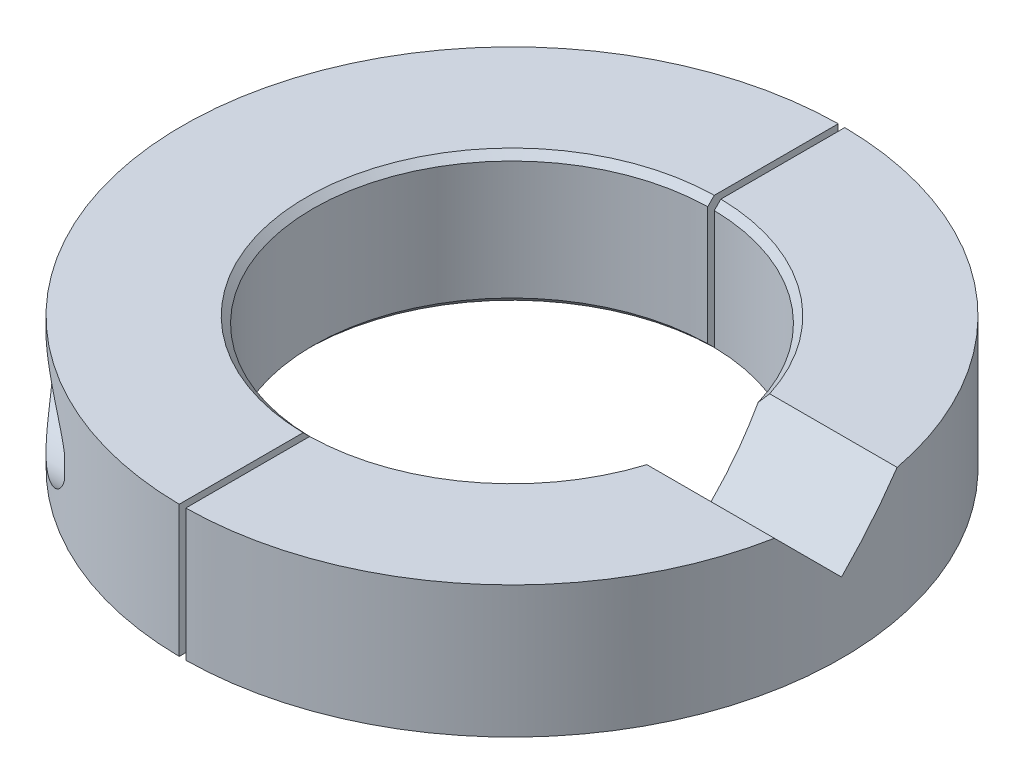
from build123d import *

# Parameters (mm, degrees)
ESQUISSE1_R                          = 25
ESQUISSE1_R_2                        = 15.1
BOSS_EXTRU_1_DEPTH                   = 5
ENL_V_MAT_EXTRU_1_DEPTH              = 36.707142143
ENL_V_DE_MAT_EXTRU_MINCE1_DEPTH      = 36.707142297
ENL_V_DE_MAT_EXTRU_MINCE1_DEPTH_BACK = 36.707142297
ESQUISSE6_W                          = 0.5
ESQUISSE6_H                          = 73.28703984
CHANFREIN1_SIZE                      = 0.5
CHANFREIN2_SIZE                      = 0.5


with BuildPart() as part:
    # Esquisse1 → Boss.-Extru.1 (new, symmetric)
    with BuildSketch(Plane(origin=(0, 0, 0), x_dir=(1, 0, 0), z_dir=(0, 1, 0))):
        with Locations(Location((0, 0, 0), (0, 0, 270))):
            Circle(ESQUISSE1_R)
        with Locations(Location((0, 0, 0), (0, 0, 270))):
            Circle(ESQUISSE1_R_2, mode=Mode.SUBTRACT)
    extrude(amount=BOSS_EXTRU_1_DEPTH, both=True)

    # Esquisse2 → Enl_v. mat.-Extru.1 (cut, through all)
    with BuildSketch(Plane(origin=(0, 0, 0), x_dir=(0, 0, -1), z_dir=(1, 0, 0))):
        Polygon((-4.656854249, 5), (0, 0.343145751), (4.656854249, 5), align=None)
    extrude(amount=ENL_V_MAT_EXTRU_1_DEPTH, mode=Mode.SUBTRACT)

    # Esquisse3 → Enl_vement de mati_re-R_volution1 (revolve, cut)
    with BuildSketch(Plane(origin=(0, 0, 0), x_dir=(1, 0, 0), z_dir=(0, 1, 0))):
        Polygon((-32, 18), (-32, 14), (-12, 14), (-12, 15.9), (0, 15.9), (0, 18), align=None)
    enl_vement_de_mati_re_r_volution1 = revolve(axis=Axis((-39.867216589, 0, -18), (1, 0, 0)), mode=Mode.SUBTRACT)

    # Esquisse4 → Trou taraud_ M41 (revolve, cut)
    with BuildSketch(Plane(origin=(0, 0, -18), x_dir=(0, 0, 1), z_dir=(0, 1, 0))):
        Polygon((0, 0), (0, 12.991420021), (1.65, 12), (1.65, 0), align=None)
    trou_taraud_m41 = revolve(axis=Axis((-6.35, 0, -18), (1, 0, 0)), mode=Mode.SUBTRACT)

    # Sym_trie1: Enl_vement de mati_re-R_volution1, Trou taraud_ M41 across plane
    add(enl_vement_de_mati_re_r_volution1.mirror(Plane.XY), mode=Mode.SUBTRACT)
    add(trou_taraud_m41.mirror(Plane.XY), mode=Mode.SUBTRACT)

    # Esquisse6 → Enl_v. de mat.-Extru.-Mince1 (cut, two sides: drawn at the far end of the back side and taken through both)
    with BuildSketch(Plane(origin=(0, 0, 0), x_dir=(1, 0, 0), z_dir=(0, 1, 0)).offset(-ENL_V_DE_MAT_EXTRU_MINCE1_DEPTH_BACK)):
        Rectangle(ESQUISSE6_W, ESQUISSE6_H)
    extrude(amount=ENL_V_DE_MAT_EXTRU_MINCE1_DEPTH + ENL_V_DE_MAT_EXTRU_MINCE1_DEPTH_BACK, mode=Mode.SUBTRACT)


with BuildPart() as enl_v_de_mat_extru_mince1_piece_1:
    # of the separate pieces the step leaves, piece 1, a body of its own (enl_v_de_mat_extru_mince1_pieces)
    add(part.part.solids().sort_by_distance((0.25, -5, 15.097930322))[0])

    # Chanfrein2
    chanfrein2_edges = [enl_v_de_mat_extru_mince1_piece_1.edges().sort_by_distance(p)[0] for p in [
        (15.1, -5, 0),
        (8.980315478, 5, 12.139354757),
        (8.980315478, 5, -12.139354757),
    ]]
    chamfer(chanfrein2_edges, length=CHANFREIN2_SIZE)


with BuildPart() as enl_v_de_mat_extru_mince1_piece_2:
    # of the separate pieces the step leaves, piece 2, a body of its own (enl_v_de_mat_extru_mince1_pieces)
    add(part.part.solids().sort_by_distance((-0.25, -5, -24.998749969))[0])

    # Chanfrein1
    chanfrein1_edges = [enl_v_de_mat_extru_mince1_piece_2.edges().sort_by_distance(p)[0] for p in [
        (-15.1, 5, 0),
        (-15.1, -5, 0),
    ]]
    chamfer(chanfrein1_edges, length=CHANFREIN1_SIZE)


solid = Compound([enl_v_de_mat_extru_mince1_piece_1.part, enl_v_de_mat_extru_mince1_piece_2.part])
